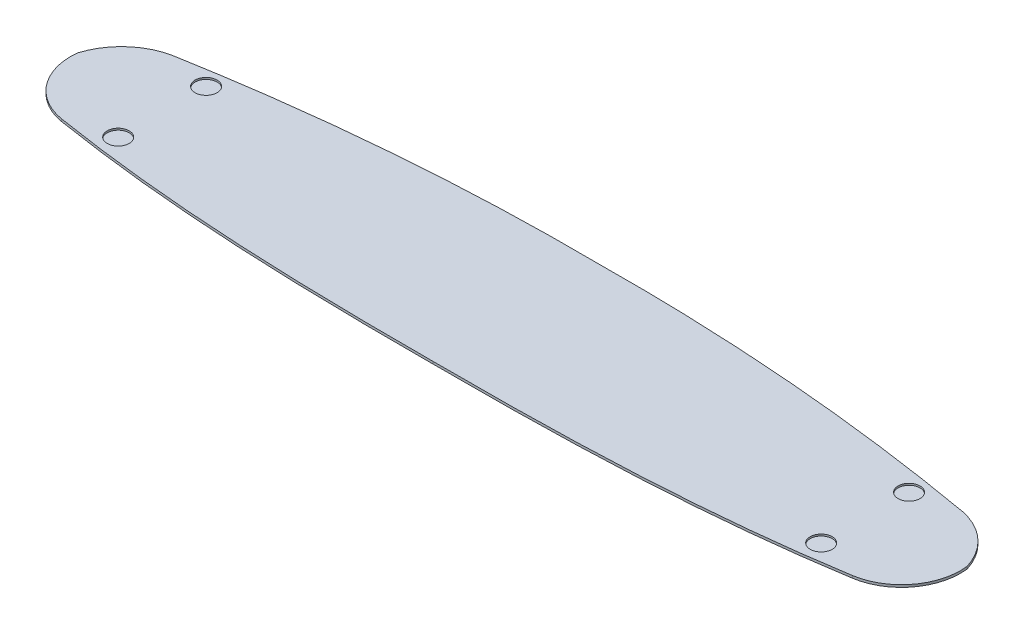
ISO-10303-21;
HEADER;
FILE_DESCRIPTION(('STEP AP214'),'2;1');
FILE_NAME('part.step','',(''),(''),'','','');
FILE_SCHEMA(('AUTOMOTIVE_DESIGN { 1 0 10303 214 1 1 1 1 }'));
ENDSEC;
DATA;
#1=APPLICATION_CONTEXT('core data for automotive mechanical design processes');
#2=APPLICATION_PROTOCOL_DEFINITION('international standard','automotive_design',2000,#1);
#3=PRODUCT_CONTEXT('',#1,'mechanical');
#4=PRODUCT('Part','Part','',(#3));
#5=PRODUCT_RELATED_PRODUCT_CATEGORY('part','',(#4));
#6=PRODUCT_DEFINITION_FORMATION('','',#4);
#7=PRODUCT_DEFINITION_CONTEXT('part definition',#1,'design');
#8=PRODUCT_DEFINITION('design','',#6,#7);
#9=PRODUCT_DEFINITION_SHAPE('','',#8);
#10=(LENGTH_UNIT() NAMED_UNIT(*) SI_UNIT(.MILLI.,.METRE.));
#11=(NAMED_UNIT(*) PLANE_ANGLE_UNIT() SI_UNIT($,.RADIAN.));
#12=(NAMED_UNIT(*) SI_UNIT($,.STERADIAN.) SOLID_ANGLE_UNIT());
#13=UNCERTAINTY_MEASURE_WITH_UNIT(LENGTH_MEASURE(1.E-05),#10,'distance_accuracy_value','');
#14=(GEOMETRIC_REPRESENTATION_CONTEXT(3) GLOBAL_UNCERTAINTY_ASSIGNED_CONTEXT((#13)) GLOBAL_UNIT_ASSIGNED_CONTEXT((#10,
#11,#12)) REPRESENTATION_CONTEXT('',''));
#15=CARTESIAN_POINT('',(0.,0.,0.));
#16=DIRECTION('',(0.,0.,1.));
#17=DIRECTION('',(1.,0.,0.));
#18=AXIS2_PLACEMENT_3D('',#15,#16,#17);
#19=CARTESIAN_POINT('',(0.,-0.78105,31.5068579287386));
#20=CARTESIAN_POINT('',(-28.8040075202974,-0.78105,31.1946244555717));
#21=CARTESIAN_POINT('',(-57.15,-0.78105,36.2165380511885));
#22=B_SPLINE_CURVE_WITH_KNOTS('',2,(#19,#20,#21),.UNSPECIFIED.,.F.,.F.,(3,3),(0.,1.),.UNSPECIFIED.);
#23=DIRECTION('',(0.,1.,0.));
#24=VECTOR('',#23,1.);
#25=SURFACE_OF_LINEAR_EXTRUSION('',#22,#24);
#26=CARTESIAN_POINT('',(0.,-0.43815,31.5068579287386));
#27=CARTESIAN_POINT('',(-28.8040075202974,-0.43815,31.1946244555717));
#28=CARTESIAN_POINT('',(-57.15,-0.43815,36.2165380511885));
#29=B_SPLINE_CURVE_WITH_KNOTS('',2,(#26,#27,#28),.UNSPECIFIED.,.F.,.F.,(3,3),(0.,1.),.UNSPECIFIED.);
#30=CARTESIAN_POINT('',(0.,-0.43815,31.5068579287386));
#31=VERTEX_POINT('',#30);
#32=CARTESIAN_POINT('',(-57.15,-0.43815,36.2165380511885));
#33=VERTEX_POINT('',#32);
#34=EDGE_CURVE('E144',#31,#33,#29,.T.);
#35=ORIENTED_EDGE('',*,*,#34,.F.);
#36=DIRECTION('',(0.,1.,0.));
#37=VECTOR('',#36,1.);
#38=CARTESIAN_POINT('',(0.,-0.78105,31.5068579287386));
#39=LINE('',#38,#37);
#40=CARTESIAN_POINT('',(0.,-0.78105,31.5068579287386));
#41=VERTEX_POINT('',#40);
#42=EDGE_CURVE('E11',#41,#31,#39,.T.);
#43=ORIENTED_EDGE('',*,*,#42,.F.);
#44=CARTESIAN_POINT('',(-57.15,-0.78105,36.2165380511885));
#45=VERTEX_POINT('',#44);
#46=EDGE_CURVE('E183',#41,#45,#22,.T.);
#47=ORIENTED_EDGE('',*,*,#46,.T.);
#48=DIRECTION('',(0.,1.,0.));
#49=VECTOR('',#48,1.);
#50=CARTESIAN_POINT('',(-57.15,-0.78105,36.2165380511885));
#51=LINE('',#50,#49);
#52=EDGE_CURVE('E44',#45,#33,#51,.T.);
#53=ORIENTED_EDGE('',*,*,#52,.T.);
#54=EDGE_LOOP('',(#35,#43,#47,#53));
#55=FACE_BOUND('',#54,.T.);
#56=ADVANCED_FACE('F40',(#55),#25,.T.);
#57=CARTESIAN_POINT('',(57.15,-0.78105,36.2165380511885));
#58=CARTESIAN_POINT('',(28.8040075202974,-0.78105,31.1946244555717));
#59=CARTESIAN_POINT('',(0.,-0.78105,31.5068579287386));
#60=B_SPLINE_CURVE_WITH_KNOTS('',2,(#57,#58,#59),.UNSPECIFIED.,.F.,.F.,(3,3),(0.,1.),.UNSPECIFIED.);
#61=DIRECTION('',(0.,1.,0.));
#62=VECTOR('',#61,1.);
#63=SURFACE_OF_LINEAR_EXTRUSION('',#60,#62);
#64=CARTESIAN_POINT('',(57.15,-0.43815,36.2165380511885));
#65=CARTESIAN_POINT('',(28.8040075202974,-0.43815,31.1946244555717));
#66=CARTESIAN_POINT('',(0.,-0.43815,31.5068579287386));
#67=B_SPLINE_CURVE_WITH_KNOTS('',2,(#64,#65,#66),.UNSPECIFIED.,.F.,.F.,(3,3),(0.,1.),.UNSPECIFIED.);
#68=CARTESIAN_POINT('',(57.15,-0.43815,36.2165380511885));
#69=VERTEX_POINT('',#68);
#70=EDGE_CURVE('E188',#69,#31,#67,.T.);
#71=ORIENTED_EDGE('',*,*,#70,.F.);
#72=DIRECTION('',(0.,1.,0.));
#73=VECTOR('',#72,1.);
#74=CARTESIAN_POINT('',(57.15,-0.78105,36.2165380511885));
#75=LINE('',#74,#73);
#76=CARTESIAN_POINT('',(57.15,-0.78105,36.2165380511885));
#77=VERTEX_POINT('',#76);
#78=EDGE_CURVE('E50',#77,#69,#75,.T.);
#79=ORIENTED_EDGE('',*,*,#78,.F.);
#80=EDGE_CURVE('E128',#77,#41,#60,.T.);
#81=ORIENTED_EDGE('',*,*,#80,.T.);
#82=ORIENTED_EDGE('',*,*,#42,.T.);
#83=EDGE_LOOP('',(#71,#79,#81,#82));
#84=FACE_BOUND('',#83,.T.);
#85=ADVANCED_FACE('F152',(#84),#63,.T.);
#86=CARTESIAN_POINT('',(55.1977435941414,-0.78105,45.4931483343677));
#87=DIRECTION('',(0.,1.,0.));
#88=DIRECTION('',(0.,0.,1.));
#89=AXIS2_PLACEMENT_3D('',#86,#87,#88);
#90=CYLINDRICAL_SURFACE('',#89,9.47981030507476);
#91=CARTESIAN_POINT('',(55.1977435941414,-0.43815,45.4931483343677));
#92=DIRECTION('',(0.,1.,0.));
#93=DIRECTION('',(0.,0.,1.));
#94=AXIS2_PLACEMENT_3D('',#91,#92,#93);
#95=CIRCLE('',#94,9.47981030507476);
#96=CARTESIAN_POINT('',(64.2663893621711,-0.43815,42.7315423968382));
#97=VERTEX_POINT('',#96);
#98=EDGE_CURVE('E115',#97,#69,#95,.T.);
#99=ORIENTED_EDGE('',*,*,#98,.F.);
#100=DIRECTION('',(0.,1.,0.));
#101=VECTOR('',#100,1.);
#102=CARTESIAN_POINT('',(64.2663893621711,-0.78105,42.7315423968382));
#103=LINE('',#102,#101);
#104=CARTESIAN_POINT('',(64.2663893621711,-0.78105,42.7315423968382));
#105=VERTEX_POINT('',#104);
#106=EDGE_CURVE('E110',#105,#97,#103,.T.);
#107=ORIENTED_EDGE('',*,*,#106,.F.);
#108=CARTESIAN_POINT('',(55.1977435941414,-0.78105,45.4931483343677));
#109=DIRECTION('',(0.,1.,0.));
#110=DIRECTION('',(0.,0.,1.));
#111=AXIS2_PLACEMENT_3D('',#108,#109,#110);
#112=CIRCLE('',#111,9.47981030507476);
#113=EDGE_CURVE('E113',#105,#77,#112,.T.);
#114=ORIENTED_EDGE('',*,*,#113,.T.);
#115=ORIENTED_EDGE('',*,*,#78,.T.);
#116=EDGE_LOOP('',(#99,#107,#114,#115));
#117=FACE_BOUND('',#116,.T.);
#118=ADVANCED_FACE('F112',(#117),#90,.T.);
#119=CARTESIAN_POINT('',(55.7888083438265,-0.78105,43.7340594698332));
#120=DIRECTION('',(0.,1.,0.));
#121=DIRECTION('',(0.,0.,1.));
#122=AXIS2_PLACEMENT_3D('',#119,#120,#121);
#123=CYLINDRICAL_SURFACE('',#122,8.53665159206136);
#124=CARTESIAN_POINT('',(55.7888083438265,-0.43815,43.7340594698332));
#125=DIRECTION('',(0.,1.,0.));
#126=DIRECTION('',(0.,0.,1.));
#127=AXIS2_PLACEMENT_3D('',#124,#125,#126);
#128=CIRCLE('',#127,8.53665159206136);
#129=CARTESIAN_POINT('',(57.15,-0.43815,52.1614895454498));
#130=VERTEX_POINT('',#129);
#131=EDGE_CURVE('E253',#130,#97,#128,.T.);
#132=ORIENTED_EDGE('',*,*,#131,.F.);
#133=DIRECTION('',(0.,1.,0.));
#134=VECTOR('',#133,1.);
#135=CARTESIAN_POINT('',(57.15,-0.78105,52.1614895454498));
#136=LINE('',#135,#134);
#137=CARTESIAN_POINT('',(57.15,-0.78105,52.1614895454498));
#138=VERTEX_POINT('',#137);
#139=EDGE_CURVE('E120',#138,#130,#136,.T.);
#140=ORIENTED_EDGE('',*,*,#139,.F.);
#141=CARTESIAN_POINT('',(55.7888083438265,-0.78105,43.7340594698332));
#142=DIRECTION('',(0.,1.,0.));
#143=DIRECTION('',(0.,0.,1.));
#144=AXIS2_PLACEMENT_3D('',#141,#142,#143);
#145=CIRCLE('',#144,8.53665159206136);
#146=EDGE_CURVE('E126',#138,#105,#145,.T.);
#147=ORIENTED_EDGE('',*,*,#146,.T.);
#148=ORIENTED_EDGE('',*,*,#106,.T.);
#149=EDGE_LOOP('',(#132,#140,#147,#148));
#150=FACE_BOUND('',#149,.T.);
#151=ADVANCED_FACE('F130',(#150),#123,.T.);
#152=CARTESIAN_POINT('',(0.,-0.78105,55.6695688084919));
#153=CARTESIAN_POINT('',(19.0919753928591,-0.78105,55.7310124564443));
#154=CARTESIAN_POINT('',(38.2501087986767,-0.78105,55.2141846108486));
#155=CARTESIAN_POINT('',(57.15,-0.78105,52.1614895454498));
#156=B_SPLINE_CURVE_WITH_KNOTS('',3,(#152,#153,#154,#155),.UNSPECIFIED.,.F.,.F.,(4,4),(0.,1.),.UNSPECIFIED.);
#157=DIRECTION('',(0.,1.,0.));
#158=VECTOR('',#157,1.);
#159=SURFACE_OF_LINEAR_EXTRUSION('',#156,#158);
#160=CARTESIAN_POINT('',(0.,-0.43815,55.6695688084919));
#161=CARTESIAN_POINT('',(19.0919753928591,-0.43815,55.7310124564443));
#162=CARTESIAN_POINT('',(38.2501087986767,-0.43815,55.2141846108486));
#163=CARTESIAN_POINT('',(57.15,-0.43815,52.1614895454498));
#164=B_SPLINE_CURVE_WITH_KNOTS('',3,(#160,#161,#162,#163),.UNSPECIFIED.,.F.,.F.,(4,4),(0.,1.),.UNSPECIFIED.);
#165=CARTESIAN_POINT('',(0.,-0.43815,55.6695688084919));
#166=VERTEX_POINT('',#165);
#167=EDGE_CURVE('E245',#166,#130,#164,.T.);
#168=ORIENTED_EDGE('',*,*,#167,.F.);
#169=DIRECTION('',(0.,1.,0.));
#170=VECTOR('',#169,1.);
#171=CARTESIAN_POINT('',(0.,-0.78105,55.6695688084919));
#172=LINE('',#171,#170);
#173=CARTESIAN_POINT('',(0.,-0.78105,55.6695688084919));
#174=VERTEX_POINT('',#173);
#175=EDGE_CURVE('E267',#174,#166,#172,.T.);
#176=ORIENTED_EDGE('',*,*,#175,.F.);
#177=EDGE_CURVE('E131',#174,#138,#156,.T.);
#178=ORIENTED_EDGE('',*,*,#177,.T.);
#179=ORIENTED_EDGE('',*,*,#139,.T.);
#180=EDGE_LOOP('',(#168,#176,#178,#179));
#181=FACE_BOUND('',#180,.T.);
#182=ADVANCED_FACE('F162',(#181),#159,.T.);
#183=CARTESIAN_POINT('',(-57.15,-0.78105,52.1614895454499));
#184=CARTESIAN_POINT('',(-38.2501087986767,-0.78105,55.2141846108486));
#185=CARTESIAN_POINT('',(-19.0919753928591,-0.78105,55.7310124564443));
#186=CARTESIAN_POINT('',(0.,-0.78105,55.6695688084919));
#187=B_SPLINE_CURVE_WITH_KNOTS('',3,(#183,#184,#185,#186),.UNSPECIFIED.,.F.,.F.,(4,4),(0.,1.),.UNSPECIFIED.);
#188=DIRECTION('',(0.,1.,0.));
#189=VECTOR('',#188,1.);
#190=SURFACE_OF_LINEAR_EXTRUSION('',#187,#189);
#191=CARTESIAN_POINT('',(-57.15,-0.43815,52.1614895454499));
#192=CARTESIAN_POINT('',(-38.2501087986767,-0.43815,55.2141846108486));
#193=CARTESIAN_POINT('',(-19.0919753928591,-0.43815,55.7310124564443));
#194=CARTESIAN_POINT('',(0.,-0.43815,55.6695688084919));
#195=B_SPLINE_CURVE_WITH_KNOTS('',3,(#191,#192,#193,#194),.UNSPECIFIED.,.F.,.F.,(4,4),(0.,1.),.UNSPECIFIED.);
#196=CARTESIAN_POINT('',(-57.15,-0.43815,52.1614895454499));
#197=VERTEX_POINT('',#196);
#198=EDGE_CURVE('E238',#197,#166,#195,.T.);
#199=ORIENTED_EDGE('',*,*,#198,.F.);
#200=DIRECTION('',(0.,1.,0.));
#201=VECTOR('',#200,1.);
#202=CARTESIAN_POINT('',(-57.15,-0.78105,52.1614895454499));
#203=LINE('',#202,#201);
#204=CARTESIAN_POINT('',(-57.15,-0.78105,52.1614895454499));
#205=VERTEX_POINT('',#204);
#206=EDGE_CURVE('E269',#205,#197,#203,.T.);
#207=ORIENTED_EDGE('',*,*,#206,.F.);
#208=EDGE_CURVE('E133',#205,#174,#187,.T.);
#209=ORIENTED_EDGE('',*,*,#208,.T.);
#210=ORIENTED_EDGE('',*,*,#175,.T.);
#211=EDGE_LOOP('',(#199,#207,#209,#210));
#212=FACE_BOUND('',#211,.T.);
#213=ADVANCED_FACE('F165',(#212),#190,.T.);
#214=CARTESIAN_POINT('',(-55.7888083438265,-0.78105,43.7340594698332));
#215=DIRECTION('',(0.,1.,0.));
#216=DIRECTION('',(0.,0.,1.));
#217=AXIS2_PLACEMENT_3D('',#214,#215,#216);
#218=CYLINDRICAL_SURFACE('',#217,8.53665159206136);
#219=CARTESIAN_POINT('',(-55.7888083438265,-0.43815,43.7340594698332));
#220=DIRECTION('',(0.,1.,0.));
#221=DIRECTION('',(0.,0.,-1.));
#222=AXIS2_PLACEMENT_3D('',#219,#220,#221);
#223=CIRCLE('',#222,8.53665159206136);
#224=CARTESIAN_POINT('',(-64.2663893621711,-0.43815,42.7315423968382));
#225=VERTEX_POINT('',#224);
#226=EDGE_CURVE('E237',#225,#197,#223,.T.);
#227=ORIENTED_EDGE('',*,*,#226,.F.);
#228=DIRECTION('',(0.,1.,0.));
#229=VECTOR('',#228,1.);
#230=CARTESIAN_POINT('',(-64.2663893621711,-0.78105,42.7315423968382));
#231=LINE('',#230,#229);
#232=CARTESIAN_POINT('',(-64.2663893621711,-0.78105,42.7315423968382));
#233=VERTEX_POINT('',#232);
#234=EDGE_CURVE('E270',#233,#225,#231,.T.);
#235=ORIENTED_EDGE('',*,*,#234,.F.);
#236=CARTESIAN_POINT('',(-55.7888083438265,-0.78105,43.7340594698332));
#237=DIRECTION('',(0.,1.,0.));
#238=DIRECTION('',(0.,0.,-1.));
#239=AXIS2_PLACEMENT_3D('',#236,#237,#238);
#240=CIRCLE('',#239,8.53665159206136);
#241=EDGE_CURVE('E176',#233,#205,#240,.T.);
#242=ORIENTED_EDGE('',*,*,#241,.T.);
#243=ORIENTED_EDGE('',*,*,#206,.T.);
#244=EDGE_LOOP('',(#227,#235,#242,#243));
#245=FACE_BOUND('',#244,.T.);
#246=ADVANCED_FACE('F169',(#245),#218,.T.);
#247=CARTESIAN_POINT('',(-55.1977435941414,-0.78105,45.4931483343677));
#248=DIRECTION('',(0.,1.,0.));
#249=DIRECTION('',(0.,0.,1.));
#250=AXIS2_PLACEMENT_3D('',#247,#248,#249);
#251=CYLINDRICAL_SURFACE('',#250,9.47981030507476);
#252=CARTESIAN_POINT('',(-55.1977435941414,-0.43815,45.4931483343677));
#253=DIRECTION('',(0.,1.,0.));
#254=DIRECTION('',(0.,0.,-1.));
#255=AXIS2_PLACEMENT_3D('',#252,#253,#254);
#256=CIRCLE('',#255,9.47981030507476);
#257=EDGE_CURVE('E236',#33,#225,#256,.T.);
#258=ORIENTED_EDGE('',*,*,#257,.F.);
#259=ORIENTED_EDGE('',*,*,#52,.F.);
#260=CARTESIAN_POINT('',(-55.1977435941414,-0.78105,45.4931483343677));
#261=DIRECTION('',(0.,1.,0.));
#262=DIRECTION('',(0.,0.,-1.));
#263=AXIS2_PLACEMENT_3D('',#260,#261,#262);
#264=CIRCLE('',#263,9.47981030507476);
#265=EDGE_CURVE('E182',#45,#233,#264,.T.);
#266=ORIENTED_EDGE('',*,*,#265,.T.);
#267=ORIENTED_EDGE('',*,*,#234,.T.);
#268=EDGE_LOOP('',(#258,#259,#266,#267));
#269=FACE_BOUND('',#268,.T.);
#270=ADVANCED_FACE('F272',(#269),#251,.T.);
#271=CARTESIAN_POINT('',(-28.6895037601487,-0.78105,32.5281612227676));
#272=DIRECTION('',(0.,1.,0.));
#273=DIRECTION('',(0.,0.,1.));
#274=AXIS2_PLACEMENT_3D('',#271,#272,#273);
#275=PLANE('',#274);
#276=ORIENTED_EDGE('',*,*,#46,.F.);
#277=ORIENTED_EDGE('',*,*,#80,.F.);
#278=ORIENTED_EDGE('',*,*,#113,.F.);
#279=ORIENTED_EDGE('',*,*,#146,.F.);
#280=ORIENTED_EDGE('',*,*,#177,.F.);
#281=ORIENTED_EDGE('',*,*,#208,.F.);
#282=ORIENTED_EDGE('',*,*,#241,.F.);
#283=ORIENTED_EDGE('',*,*,#265,.F.);
#284=EDGE_LOOP('',(#276,#277,#278,#279,#280,#281,#282,#283));
#285=FACE_BOUND('',#284,.T.);
#286=ADVANCED_FACE('F124',(#285),#275,.F.);
#287=CARTESIAN_POINT('',(-28.6895037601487,-0.43815,32.5281612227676));
#288=DIRECTION('',(0.,1.,0.));
#289=DIRECTION('',(0.,0.,1.));
#290=AXIS2_PLACEMENT_3D('',#287,#288,#289);
#291=PLANE('',#290);
#292=CARTESIAN_POINT('',(-50.8,-0.43815,50.3515423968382));
#293=DIRECTION('',(0.,1.,0.));
#294=DIRECTION('',(0.,0.,-1.));
#295=AXIS2_PLACEMENT_3D('',#292,#293,#294);
#296=CIRCLE('',#295,1.5875);
#297=CARTESIAN_POINT('',(-50.8,-0.43815,48.7640423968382));
#298=VERTEX_POINT('',#297);
#299=EDGE_CURVE('E199',#298,#298,#296,.T.);
#300=ORIENTED_EDGE('',*,*,#299,.F.);
#301=EDGE_LOOP('',(#300));
#302=FACE_BOUND('',#301,.T.);
#303=CARTESIAN_POINT('',(-50.8,-0.43815,37.6515423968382));
#304=DIRECTION('',(0.,1.,0.));
#305=DIRECTION('',(0.,0.,-1.));
#306=AXIS2_PLACEMENT_3D('',#303,#304,#305);
#307=CIRCLE('',#306,1.5875);
#308=CARTESIAN_POINT('',(-50.8,-0.43815,36.0640423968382));
#309=VERTEX_POINT('',#308);
#310=EDGE_CURVE('E205',#309,#309,#307,.T.);
#311=ORIENTED_EDGE('',*,*,#310,.F.);
#312=EDGE_LOOP('',(#311));
#313=FACE_BOUND('',#312,.T.);
#314=CARTESIAN_POINT('',(50.8,-0.43815,37.6515423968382));
#315=DIRECTION('',(0.,1.,0.));
#316=DIRECTION('',(0.,0.,1.));
#317=AXIS2_PLACEMENT_3D('',#314,#315,#316);
#318=CIRCLE('',#317,1.5875);
#319=CARTESIAN_POINT('',(50.8,-0.43815,39.2390423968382));
#320=VERTEX_POINT('',#319);
#321=EDGE_CURVE('E211',#320,#320,#318,.T.);
#322=ORIENTED_EDGE('',*,*,#321,.F.);
#323=EDGE_LOOP('',(#322));
#324=FACE_BOUND('',#323,.T.);
#325=CARTESIAN_POINT('',(50.8,-0.43815,50.3515423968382));
#326=DIRECTION('',(0.,1.,0.));
#327=DIRECTION('',(0.,0.,1.));
#328=AXIS2_PLACEMENT_3D('',#325,#326,#327);
#329=CIRCLE('',#328,1.5875);
#330=CARTESIAN_POINT('',(50.8,-0.43815,51.9390423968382));
#331=VERTEX_POINT('',#330);
#332=EDGE_CURVE('E189',#331,#331,#329,.T.);
#333=ORIENTED_EDGE('',*,*,#332,.F.);
#334=EDGE_LOOP('',(#333));
#335=FACE_BOUND('',#334,.T.);
#336=ORIENTED_EDGE('',*,*,#34,.T.);
#337=ORIENTED_EDGE('',*,*,#257,.T.);
#338=ORIENTED_EDGE('',*,*,#226,.T.);
#339=ORIENTED_EDGE('',*,*,#198,.T.);
#340=ORIENTED_EDGE('',*,*,#167,.T.);
#341=ORIENTED_EDGE('',*,*,#131,.T.);
#342=ORIENTED_EDGE('',*,*,#98,.T.);
#343=ORIENTED_EDGE('',*,*,#70,.T.);
#344=EDGE_LOOP('',(#336,#337,#338,#339,#340,#341,#342,#343));
#345=FACE_BOUND('',#344,.T.);
#346=ADVANCED_FACE('F156',(#302,#313,#324,#335,#345),#291,.T.);
#347=CARTESIAN_POINT('',(50.8,-0.69215,50.3515423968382));
#348=DIRECTION('',(0.,1.,0.));
#349=DIRECTION('',(0.,0.,1.));
#350=AXIS2_PLACEMENT_3D('',#347,#348,#349);
#351=CYLINDRICAL_SURFACE('',#350,1.5875);
#352=CARTESIAN_POINT('',(50.8,-0.69215,50.3515423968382));
#353=DIRECTION('',(0.,1.,0.));
#354=DIRECTION('',(0.,0.,1.));
#355=AXIS2_PLACEMENT_3D('',#352,#353,#354);
#356=CIRCLE('',#355,1.5875);
#357=CARTESIAN_POINT('',(50.8,-0.69215,51.9390423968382));
#358=VERTEX_POINT('',#357);
#359=EDGE_CURVE('E195',#358,#358,#356,.T.);
#360=ORIENTED_EDGE('',*,*,#359,.F.);
#361=EDGE_LOOP('',(#360));
#362=FACE_BOUND('',#361,.T.);
#363=ORIENTED_EDGE('',*,*,#332,.T.);
#364=EDGE_LOOP('',(#363));
#365=FACE_BOUND('',#364,.T.);
#366=ADVANCED_FACE('F228',(#362,#365),#351,.F.);
#367=CARTESIAN_POINT('',(50.8,-0.69215,50.3515423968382));
#368=DIRECTION('',(0.,1.,0.));
#369=DIRECTION('',(0.,0.,1.));
#370=AXIS2_PLACEMENT_3D('',#367,#368,#369);
#371=PLANE('',#370);
#372=ORIENTED_EDGE('',*,*,#359,.T.);
#373=EDGE_LOOP('',(#372));
#374=FACE_BOUND('',#373,.T.);
#375=ADVANCED_FACE('F222',(#374),#371,.T.);
#376=CARTESIAN_POINT('',(50.8,-0.69215,37.6515423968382));
#377=DIRECTION('',(0.,1.,0.));
#378=DIRECTION('',(0.,0.,1.));
#379=AXIS2_PLACEMENT_3D('',#376,#377,#378);
#380=CYLINDRICAL_SURFACE('',#379,1.5875);
#381=CARTESIAN_POINT('',(50.8,-0.69215,37.6515423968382));
#382=DIRECTION('',(0.,1.,0.));
#383=DIRECTION('',(0.,0.,1.));
#384=AXIS2_PLACEMENT_3D('',#381,#382,#383);
#385=CIRCLE('',#384,1.5875);
#386=CARTESIAN_POINT('',(50.8,-0.69215,39.2390423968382));
#387=VERTEX_POINT('',#386);
#388=EDGE_CURVE('E196',#387,#387,#385,.T.);
#389=ORIENTED_EDGE('',*,*,#388,.F.);
#390=EDGE_LOOP('',(#389));
#391=FACE_BOUND('',#390,.T.);
#392=ORIENTED_EDGE('',*,*,#321,.T.);
#393=EDGE_LOOP('',(#392));
#394=FACE_BOUND('',#393,.T.);
#395=ADVANCED_FACE('F219',(#391,#394),#380,.F.);
#396=CARTESIAN_POINT('',(50.8,-0.69215,37.6515423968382));
#397=DIRECTION('',(0.,1.,0.));
#398=DIRECTION('',(0.,0.,1.));
#399=AXIS2_PLACEMENT_3D('',#396,#397,#398);
#400=PLANE('',#399);
#401=ORIENTED_EDGE('',*,*,#388,.T.);
#402=EDGE_LOOP('',(#401));
#403=FACE_BOUND('',#402,.T.);
#404=ADVANCED_FACE('F217',(#403),#400,.T.);
#405=CARTESIAN_POINT('',(-50.8,-0.69215,37.6515423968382));
#406=DIRECTION('',(0.,1.,0.));
#407=DIRECTION('',(0.,0.,1.));
#408=AXIS2_PLACEMENT_3D('',#405,#406,#407);
#409=CYLINDRICAL_SURFACE('',#408,1.5875);
#410=CARTESIAN_POINT('',(-50.8,-0.69215,37.6515423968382));
#411=DIRECTION('',(0.,1.,0.));
#412=DIRECTION('',(0.,0.,-1.));
#413=AXIS2_PLACEMENT_3D('',#410,#411,#412);
#414=CIRCLE('',#413,1.5875);
#415=CARTESIAN_POINT('',(-50.8,-0.69215,36.0640423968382));
#416=VERTEX_POINT('',#415);
#417=EDGE_CURVE('E208',#416,#416,#414,.T.);
#418=ORIENTED_EDGE('',*,*,#417,.F.);
#419=EDGE_LOOP('',(#418));
#420=FACE_BOUND('',#419,.T.);
#421=ORIENTED_EDGE('',*,*,#310,.T.);
#422=EDGE_LOOP('',(#421));
#423=FACE_BOUND('',#422,.T.);
#424=ADVANCED_FACE('F361',(#420,#423),#409,.F.);
#425=CARTESIAN_POINT('',(-50.8,-0.69215,37.6515423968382));
#426=DIRECTION('',(0.,-1.,0.));
#427=DIRECTION('',(0.,0.,-1.));
#428=AXIS2_PLACEMENT_3D('',#425,#426,#427);
#429=PLANE('',#428);
#430=ORIENTED_EDGE('',*,*,#417,.T.);
#431=EDGE_LOOP('',(#430));
#432=FACE_BOUND('',#431,.T.);
#433=ADVANCED_FACE('F370',(#432),#429,.F.);
#434=CARTESIAN_POINT('',(-50.8,-0.69215,50.3515423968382));
#435=DIRECTION('',(0.,1.,0.));
#436=DIRECTION('',(0.,0.,1.));
#437=AXIS2_PLACEMENT_3D('',#434,#435,#436);
#438=CYLINDRICAL_SURFACE('',#437,1.5875);
#439=CARTESIAN_POINT('',(-50.8,-0.69215,50.3515423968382));
#440=DIRECTION('',(0.,1.,0.));
#441=DIRECTION('',(0.,0.,-1.));
#442=AXIS2_PLACEMENT_3D('',#439,#440,#441);
#443=CIRCLE('',#442,1.5875);
#444=CARTESIAN_POINT('',(-50.8,-0.69215,48.7640423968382));
#445=VERTEX_POINT('',#444);
#446=EDGE_CURVE('E202',#445,#445,#443,.T.);
#447=ORIENTED_EDGE('',*,*,#446,.F.);
#448=EDGE_LOOP('',(#447));
#449=FACE_BOUND('',#448,.T.);
#450=ORIENTED_EDGE('',*,*,#299,.T.);
#451=EDGE_LOOP('',(#450));
#452=FACE_BOUND('',#451,.T.);
#453=ADVANCED_FACE('F381',(#449,#452),#438,.F.);
#454=CARTESIAN_POINT('',(-50.8,-0.69215,50.3515423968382));
#455=DIRECTION('',(0.,-1.,0.));
#456=DIRECTION('',(0.,0.,-1.));
#457=AXIS2_PLACEMENT_3D('',#454,#455,#456);
#458=PLANE('',#457);
#459=ORIENTED_EDGE('',*,*,#446,.T.);
#460=EDGE_LOOP('',(#459));
#461=FACE_BOUND('',#460,.T.);
#462=ADVANCED_FACE('F391',(#461),#458,.F.);
#463=CLOSED_SHELL('',(#56,#85,#118,#151,#182,#213,#246,#270,#286,#346,#366,#375,#395,#404,#424,
#433,#453,#462));
#464=MANIFOLD_SOLID_BREP('B2',#463);
#465=ADVANCED_BREP_SHAPE_REPRESENTATION('',(#18,#464),#14);
#466=SHAPE_DEFINITION_REPRESENTATION(#9,#465);
ENDSEC;
END-ISO-10303-21;
